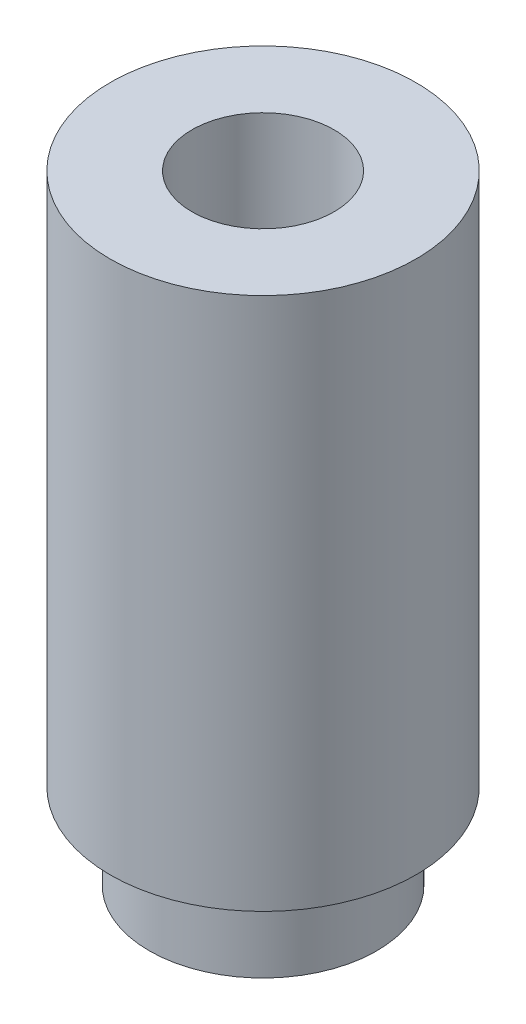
ISO-10303-21;
HEADER;
FILE_DESCRIPTION(('STEP AP214'),'2;1');
FILE_NAME('part.step','',(''),(''),'','','');
FILE_SCHEMA(('AUTOMOTIVE_DESIGN { 1 0 10303 214 1 1 1 1 }'));
ENDSEC;
DATA;
#1=APPLICATION_CONTEXT('core data for automotive mechanical design processes');
#2=APPLICATION_PROTOCOL_DEFINITION('international standard','automotive_design',2000,#1);
#3=PRODUCT_CONTEXT('',#1,'mechanical');
#4=PRODUCT('Part','Part','',(#3));
#5=PRODUCT_RELATED_PRODUCT_CATEGORY('part','',(#4));
#6=PRODUCT_DEFINITION_FORMATION('','',#4);
#7=PRODUCT_DEFINITION_CONTEXT('part definition',#1,'design');
#8=PRODUCT_DEFINITION('design','',#6,#7);
#9=PRODUCT_DEFINITION_SHAPE('','',#8);
#10=(LENGTH_UNIT() NAMED_UNIT(*) SI_UNIT(.MILLI.,.METRE.));
#11=(NAMED_UNIT(*) PLANE_ANGLE_UNIT() SI_UNIT($,.RADIAN.));
#12=(NAMED_UNIT(*) SI_UNIT($,.STERADIAN.) SOLID_ANGLE_UNIT());
#13=UNCERTAINTY_MEASURE_WITH_UNIT(LENGTH_MEASURE(1.E-05),#10,'distance_accuracy_value','');
#14=(GEOMETRIC_REPRESENTATION_CONTEXT(3) GLOBAL_UNCERTAINTY_ASSIGNED_CONTEXT((#13)) GLOBAL_UNIT_ASSIGNED_CONTEXT((#10,
#11,#12)) REPRESENTATION_CONTEXT('',''));
#15=CARTESIAN_POINT('',(0.,0.,0.));
#16=DIRECTION('',(0.,0.,1.));
#17=DIRECTION('',(1.,0.,0.));
#18=AXIS2_PLACEMENT_3D('',#15,#16,#17);
#19=CARTESIAN_POINT('',(0.,7.5,0.));
#20=DIRECTION('',(0.,1.,0.));
#21=DIRECTION('',(0.,0.,1.));
#22=AXIS2_PLACEMENT_3D('',#19,#20,#21);
#23=CYLINDRICAL_SURFACE('',#22,2.15);
#24=CARTESIAN_POINT('',(0.,7.5,0.));
#25=DIRECTION('',(0.,1.,0.));
#26=DIRECTION('',(0.,0.,1.));
#27=AXIS2_PLACEMENT_3D('',#24,#25,#26);
#28=CIRCLE('',#27,2.15);
#29=CARTESIAN_POINT('',(0.,7.5,2.15));
#30=VERTEX_POINT('',#29);
#31=EDGE_CURVE('E61',#30,#30,#28,.T.);
#32=ORIENTED_EDGE('',*,*,#31,.F.);
#33=EDGE_LOOP('',(#32));
#34=FACE_BOUND('',#33,.T.);
#35=CARTESIAN_POINT('',(0.,0.,0.));
#36=DIRECTION('',(0.,1.,0.));
#37=DIRECTION('',(0.,0.,1.));
#38=AXIS2_PLACEMENT_3D('',#35,#36,#37);
#39=CIRCLE('',#38,2.15);
#40=CARTESIAN_POINT('',(0.,0.,2.15));
#41=VERTEX_POINT('',#40);
#42=EDGE_CURVE('E10',#41,#41,#39,.T.);
#43=ORIENTED_EDGE('',*,*,#42,.T.);
#44=EDGE_LOOP('',(#43));
#45=FACE_BOUND('',#44,.T.);
#46=ADVANCED_FACE('F39',(#34,#45),#23,.T.);
#47=CARTESIAN_POINT('',(2.15,0.,0.));
#48=DIRECTION('',(0.,1.,0.));
#49=DIRECTION('',(0.,0.,1.));
#50=AXIS2_PLACEMENT_3D('',#47,#48,#49);
#51=PLANE('',#50);
#52=ORIENTED_EDGE('',*,*,#42,.F.);
#53=EDGE_LOOP('',(#52));
#54=FACE_BOUND('',#53,.T.);
#55=CARTESIAN_POINT('',(0.,0.,0.));
#56=DIRECTION('',(0.,1.,0.));
#57=DIRECTION('',(0.,0.,1.));
#58=AXIS2_PLACEMENT_3D('',#55,#56,#57);
#59=CIRCLE('',#58,1.6);
#60=CARTESIAN_POINT('',(0.,0.,1.6));
#61=VERTEX_POINT('',#60);
#62=EDGE_CURVE('E45',#61,#61,#59,.T.);
#63=ORIENTED_EDGE('',*,*,#62,.T.);
#64=EDGE_LOOP('',(#63));
#65=FACE_BOUND('',#64,.T.);
#66=ADVANCED_FACE('F68',(#54,#65),#51,.F.);
#67=CARTESIAN_POINT('',(0.,7.5,0.));
#68=DIRECTION('',(0.,1.,0.));
#69=DIRECTION('',(0.,0.,1.));
#70=AXIS2_PLACEMENT_3D('',#67,#68,#69);
#71=CYLINDRICAL_SURFACE('',#70,1.6);
#72=ORIENTED_EDGE('',*,*,#62,.F.);
#73=EDGE_LOOP('',(#72));
#74=FACE_BOUND('',#73,.T.);
#75=CARTESIAN_POINT('',(0.,-1.2,0.));
#76=DIRECTION('',(0.,1.,0.));
#77=DIRECTION('',(0.,0.,1.));
#78=AXIS2_PLACEMENT_3D('',#75,#76,#77);
#79=CIRCLE('',#78,1.6);
#80=CARTESIAN_POINT('',(0.,-1.2,1.6));
#81=VERTEX_POINT('',#80);
#82=EDGE_CURVE('E49',#81,#81,#79,.T.);
#83=ORIENTED_EDGE('',*,*,#82,.T.);
#84=EDGE_LOOP('',(#83));
#85=FACE_BOUND('',#84,.T.);
#86=ADVANCED_FACE('F72',(#74,#85),#71,.T.);
#87=CARTESIAN_POINT('',(1.6,-1.2,0.));
#88=DIRECTION('',(0.,1.,0.));
#89=DIRECTION('',(0.,0.,1.));
#90=AXIS2_PLACEMENT_3D('',#87,#88,#89);
#91=PLANE('',#90);
#92=ORIENTED_EDGE('',*,*,#82,.F.);
#93=EDGE_LOOP('',(#92));
#94=FACE_BOUND('',#93,.T.);
#95=CARTESIAN_POINT('',(0.,-1.2,0.));
#96=DIRECTION('',(0.,1.,0.));
#97=DIRECTION('',(0.,0.,1.));
#98=AXIS2_PLACEMENT_3D('',#95,#96,#97);
#99=CIRCLE('',#98,1.);
#100=CARTESIAN_POINT('',(0.,-1.2,1.));
#101=VERTEX_POINT('',#100);
#102=EDGE_CURVE('E53',#101,#101,#99,.T.);
#103=ORIENTED_EDGE('',*,*,#102,.T.);
#104=EDGE_LOOP('',(#103));
#105=FACE_BOUND('',#104,.T.);
#106=ADVANCED_FACE('F77',(#94,#105),#91,.F.);
#107=CARTESIAN_POINT('',(0.,7.5,0.));
#108=DIRECTION('',(0.,1.,0.));
#109=DIRECTION('',(0.,0.,1.));
#110=AXIS2_PLACEMENT_3D('',#107,#108,#109);
#111=CYLINDRICAL_SURFACE('',#110,1.);
#112=ORIENTED_EDGE('',*,*,#102,.F.);
#113=EDGE_LOOP('',(#112));
#114=FACE_BOUND('',#113,.T.);
#115=CARTESIAN_POINT('',(0.,7.5,0.));
#116=DIRECTION('',(0.,1.,0.));
#117=DIRECTION('',(0.,0.,1.));
#118=AXIS2_PLACEMENT_3D('',#115,#116,#117);
#119=CIRCLE('',#118,1.);
#120=CARTESIAN_POINT('',(0.,7.5,1.));
#121=VERTEX_POINT('',#120);
#122=EDGE_CURVE('E58',#121,#121,#119,.T.);
#123=ORIENTED_EDGE('',*,*,#122,.T.);
#124=EDGE_LOOP('',(#123));
#125=FACE_BOUND('',#124,.T.);
#126=ADVANCED_FACE('F83',(#114,#125),#111,.F.);
#127=CARTESIAN_POINT('',(1.,7.5,0.));
#128=DIRECTION('',(0.,-1.,0.));
#129=DIRECTION('',(0.,0.,-1.));
#130=AXIS2_PLACEMENT_3D('',#127,#128,#129);
#131=PLANE('',#130);
#132=ORIENTED_EDGE('',*,*,#122,.F.);
#133=EDGE_LOOP('',(#132));
#134=FACE_BOUND('',#133,.T.);
#135=ORIENTED_EDGE('',*,*,#31,.T.);
#136=EDGE_LOOP('',(#135));
#137=FACE_BOUND('',#136,.T.);
#138=ADVANCED_FACE('F65',(#134,#137),#131,.F.);
#139=CLOSED_SHELL('',(#46,#66,#86,#106,#126,#138));
#140=MANIFOLD_SOLID_BREP('B2',#139);
#141=ADVANCED_BREP_SHAPE_REPRESENTATION('',(#18,#140),#14);
#142=SHAPE_DEFINITION_REPRESENTATION(#9,#141);
ENDSEC;
END-ISO-10303-21;
